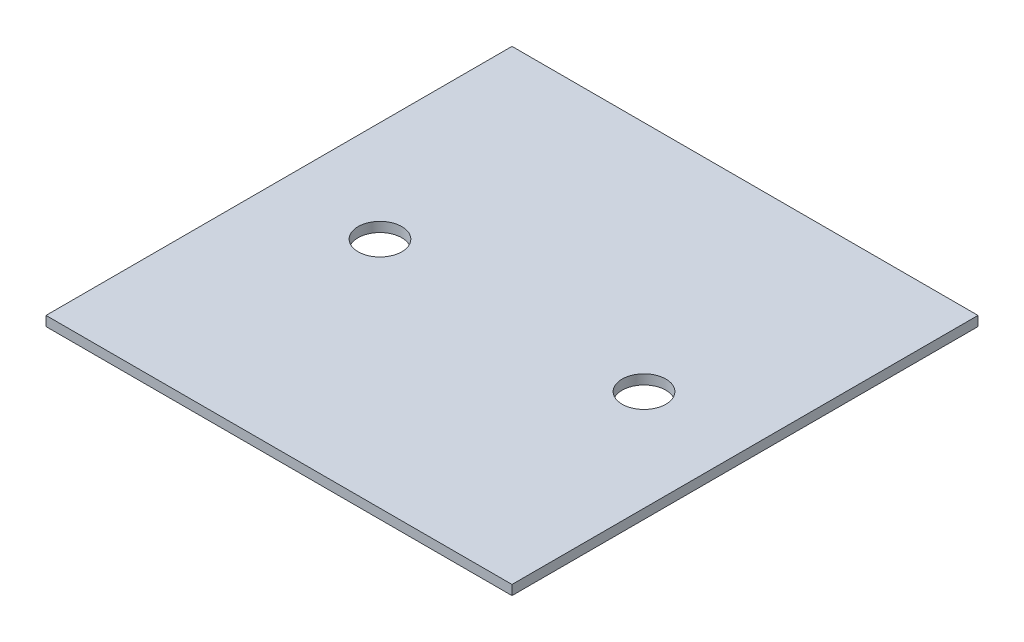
from build123d import *

# Parameters (mm, degrees)
SKETCH1_W           = 152.4
SKETCH1_H           = 152.4
BOSS_EXTRUDE1_DEPTH = 3.175
SKETCH2_R           = 7.14375
CUT_EXTRUDE1_DEPTH  = 25.4


with BuildPart() as part:
    # Sketch1 → Boss-Extrude1 (new body)
    with BuildSketch(Plane(origin=(0, 0, 0), x_dir=(1, 0, 0), z_dir=(0, 1, 0))):
        Rectangle(SKETCH1_W, SKETCH1_H)
    extrude(amount=BOSS_EXTRUDE1_DEPTH)

    # Sketch2 → Cut-Extrude1 (cut)
    with BuildSketch(Plane(origin=(0, 0, 0), x_dir=(1, 0, 0), z_dir=(0, 1, 0))):
        with Locations(Location((-43.18, 0, 0), (0, 0, 270))):
            Circle(SKETCH2_R)
        with Locations(Location((43.18, 0, 0), (0, 0, 270))):
            Circle(SKETCH2_R)
    extrude(amount=CUT_EXTRUDE1_DEPTH, mode=Mode.SUBTRACT)


solid = part.part
